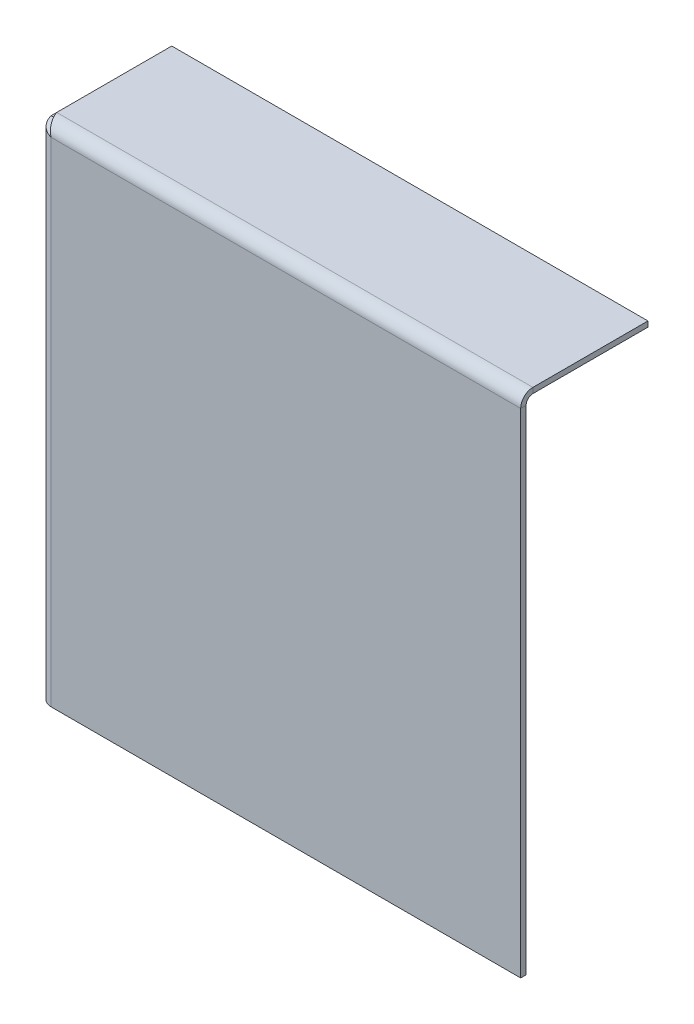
ISO-10303-21;
HEADER;
FILE_DESCRIPTION(('STEP AP214'),'2;1');
FILE_NAME('part.step','',(''),(''),'','','');
FILE_SCHEMA(('AUTOMOTIVE_DESIGN { 1 0 10303 214 1 1 1 1 }'));
ENDSEC;
DATA;
#1=APPLICATION_CONTEXT('core data for automotive mechanical design processes');
#2=APPLICATION_PROTOCOL_DEFINITION('international standard','automotive_design',2000,#1);
#3=PRODUCT_CONTEXT('',#1,'mechanical');
#4=PRODUCT('Part','Part','',(#3));
#5=PRODUCT_RELATED_PRODUCT_CATEGORY('part','',(#4));
#6=PRODUCT_DEFINITION_FORMATION('','',#4);
#7=PRODUCT_DEFINITION_CONTEXT('part definition',#1,'design');
#8=PRODUCT_DEFINITION('design','',#6,#7);
#9=PRODUCT_DEFINITION_SHAPE('','',#8);
#10=(LENGTH_UNIT() NAMED_UNIT(*) SI_UNIT(.MILLI.,.METRE.));
#11=(NAMED_UNIT(*) PLANE_ANGLE_UNIT() SI_UNIT($,.RADIAN.));
#12=(NAMED_UNIT(*) SI_UNIT($,.STERADIAN.) SOLID_ANGLE_UNIT());
#13=UNCERTAINTY_MEASURE_WITH_UNIT(LENGTH_MEASURE(1.E-05),#10,'distance_accuracy_value','');
#14=(GEOMETRIC_REPRESENTATION_CONTEXT(3) GLOBAL_UNCERTAINTY_ASSIGNED_CONTEXT((#13)) GLOBAL_UNIT_ASSIGNED_CONTEXT((#10,
#11,#12)) REPRESENTATION_CONTEXT('',''));
#15=CARTESIAN_POINT('',(0.,0.,0.));
#16=DIRECTION('',(0.,0.,1.));
#17=DIRECTION('',(1.,0.,0.));
#18=AXIS2_PLACEMENT_3D('',#15,#16,#17);
#19=CARTESIAN_POINT('',(0.,-182.191293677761,2.));
#20=DIRECTION('',(0.,1.,0.));
#21=DIRECTION('',(0.,0.,1.));
#22=AXIS2_PLACEMENT_3D('',#19,#20,#21);
#23=PLANE('',#22);
#24=DIRECTION('',(1.,0.,0.));
#25=VECTOR('',#24,1.);
#26=CARTESIAN_POINT('',(0.,-182.191293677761,0.));
#27=LINE('',#26,#25);
#28=CARTESIAN_POINT('',(0.,-182.191293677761,0.));
#29=VERTEX_POINT('',#28);
#30=CARTESIAN_POINT('',(173.469526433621,-182.191293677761,0.));
#31=VERTEX_POINT('',#30);
#32=EDGE_CURVE('E255',#29,#31,#27,.T.);
#33=ORIENTED_EDGE('',*,*,#32,.T.);
#34=DIRECTION('',(0.,0.,-1.));
#35=VECTOR('',#34,1.);
#36=CARTESIAN_POINT('',(173.469526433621,-182.191293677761,2.));
#37=LINE('',#36,#35);
#38=CARTESIAN_POINT('',(173.469526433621,-182.191293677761,2.));
#39=VERTEX_POINT('',#38);
#40=EDGE_CURVE('E83',#39,#31,#37,.T.);
#41=ORIENTED_EDGE('',*,*,#40,.F.);
#42=DIRECTION('',(1.,0.,0.));
#43=VECTOR('',#42,1.);
#44=CARTESIAN_POINT('',(0.,-182.191293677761,2.));
#45=LINE('',#44,#43);
#46=CARTESIAN_POINT('',(0.,-182.191293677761,2.));
#47=VERTEX_POINT('',#46);
#48=EDGE_CURVE('E90',#47,#39,#45,.T.);
#49=ORIENTED_EDGE('',*,*,#48,.F.);
#50=DIRECTION('',(0.,0.,-1.));
#51=VECTOR('',#50,1.);
#52=CARTESIAN_POINT('',(0.,-182.191293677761,2.));
#53=LINE('',#52,#51);
#54=EDGE_CURVE('E13',#47,#29,#53,.T.);
#55=ORIENTED_EDGE('',*,*,#54,.T.);
#56=EDGE_LOOP('',(#33,#41,#49,#55));
#57=FACE_BOUND('',#56,.T.);
#58=ADVANCED_FACE('F75',(#57),#23,.F.);
#59=CARTESIAN_POINT('',(173.469526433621,0.,2.));
#60=DIRECTION('',(-1.,0.,0.));
#61=DIRECTION('',(0.,-1.,0.));
#62=AXIS2_PLACEMENT_3D('',#59,#60,#61);
#63=PLANE('',#62);
#64=DIRECTION('',(0.,1.,0.));
#65=VECTOR('',#64,1.);
#66=CARTESIAN_POINT('',(173.469526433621,0.,0.));
#67=LINE('',#66,#65);
#68=CARTESIAN_POINT('',(173.469526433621,0.,0.));
#69=VERTEX_POINT('',#68);
#70=EDGE_CURVE('E262',#31,#69,#67,.T.);
#71=ORIENTED_EDGE('',*,*,#70,.T.);
#72=DIRECTION('',(0.,0.,-1.));
#73=VECTOR('',#72,1.);
#74=CARTESIAN_POINT('',(173.469526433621,0.,2.));
#75=LINE('',#74,#73);
#76=CARTESIAN_POINT('',(173.469526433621,0.,2.));
#77=VERTEX_POINT('',#76);
#78=EDGE_CURVE('E269',#77,#69,#75,.T.);
#79=ORIENTED_EDGE('',*,*,#78,.F.);
#80=DIRECTION('',(0.,1.,0.));
#81=VECTOR('',#80,1.);
#82=CARTESIAN_POINT('',(173.469526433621,0.,2.));
#83=LINE('',#82,#81);
#84=EDGE_CURVE('E268',#39,#77,#83,.T.);
#85=ORIENTED_EDGE('',*,*,#84,.F.);
#86=ORIENTED_EDGE('',*,*,#40,.T.);
#87=EDGE_LOOP('',(#71,#79,#85,#86));
#88=FACE_BOUND('',#87,.T.);
#89=ADVANCED_FACE('F246',(#88),#63,.F.);
#90=CARTESIAN_POINT('',(0.,-182.191293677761,2.));
#91=DIRECTION('',(0.,0.,1.));
#92=DIRECTION('',(1.,0.,0.));
#93=AXIS2_PLACEMENT_3D('',#90,#91,#92);
#94=PLANE('',#93);
#95=DIRECTION('',(0.,-1.,0.));
#96=VECTOR('',#95,1.);
#97=CARTESIAN_POINT('',(0.,0.,2.));
#98=LINE('',#97,#96);
#99=CARTESIAN_POINT('',(0.,0.,2.));
#100=VERTEX_POINT('',#99);
#101=EDGE_CURVE('E273',#100,#47,#98,.T.);
#102=ORIENTED_EDGE('',*,*,#101,.T.);
#103=ORIENTED_EDGE('',*,*,#48,.T.);
#104=ORIENTED_EDGE('',*,*,#84,.T.);
#105=DIRECTION('',(-1.,0.,0.));
#106=VECTOR('',#105,1.);
#107=CARTESIAN_POINT('',(0.,0.,2.));
#108=LINE('',#107,#106);
#109=EDGE_CURVE('E280',#77,#100,#108,.T.);
#110=ORIENTED_EDGE('',*,*,#109,.T.);
#111=EDGE_LOOP('',(#102,#103,#104,#110));
#112=FACE_BOUND('',#111,.T.);
#113=ADVANCED_FACE('F251',(#112),#94,.T.);
#114=CARTESIAN_POINT('',(0.,-182.191293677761,0.));
#115=DIRECTION('',(0.,0.,1.));
#116=DIRECTION('',(1.,0.,0.));
#117=AXIS2_PLACEMENT_3D('',#114,#115,#116);
#118=PLANE('',#117);
#119=DIRECTION('',(0.,-1.,0.));
#120=VECTOR('',#119,1.);
#121=CARTESIAN_POINT('',(0.,0.,0.));
#122=LINE('',#121,#120);
#123=CARTESIAN_POINT('',(0.,0.,0.));
#124=VERTEX_POINT('',#123);
#125=EDGE_CURVE('E263',#124,#29,#122,.T.);
#126=ORIENTED_EDGE('',*,*,#125,.F.);
#127=DIRECTION('',(-1.,0.,0.));
#128=VECTOR('',#127,1.);
#129=CARTESIAN_POINT('',(0.,0.,0.));
#130=LINE('',#129,#128);
#131=EDGE_CURVE('E271',#69,#124,#130,.T.);
#132=ORIENTED_EDGE('',*,*,#131,.F.);
#133=ORIENTED_EDGE('',*,*,#70,.F.);
#134=ORIENTED_EDGE('',*,*,#32,.F.);
#135=EDGE_LOOP('',(#126,#132,#133,#134));
#136=FACE_BOUND('',#135,.T.);
#137=ADVANCED_FACE('F270',(#136),#118,.F.);
#138=CARTESIAN_POINT('',(0.,-182.191293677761,-2.5));
#139=DIRECTION('',(0.,-1.,0.));
#140=DIRECTION('',(0.,0.,-1.));
#141=AXIS2_PLACEMENT_3D('',#138,#139,#140);
#142=PLANE('',#141);
#143=DIRECTION('',(1.,0.,0.));
#144=VECTOR('',#143,1.);
#145=CARTESIAN_POINT('',(-4.5,-182.191293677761,-2.49999999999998));
#146=LINE('',#145,#144);
#147=CARTESIAN_POINT('',(-2.5,-182.191293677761,-2.49999999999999));
#148=VERTEX_POINT('',#147);
#149=CARTESIAN_POINT('',(-4.5,-182.191293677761,-2.49999999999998));
#150=VERTEX_POINT('',#149);
#151=EDGE_CURVE('E350',#148,#150,#146,.F.);
#152=ORIENTED_EDGE('',*,*,#151,.F.);
#153=CARTESIAN_POINT('',(0.,-182.191293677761,-2.5));
#154=DIRECTION('',(0.,1.,0.));
#155=DIRECTION('',(0.,0.,1.));
#156=AXIS2_PLACEMENT_3D('',#153,#154,#155);
#157=CIRCLE('',#156,2.5);
#158=EDGE_CURVE('E308',#29,#148,#157,.F.);
#159=ORIENTED_EDGE('',*,*,#158,.F.);
#160=ORIENTED_EDGE('',*,*,#54,.F.);
#161=CARTESIAN_POINT('',(0.,-182.191293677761,-2.5));
#162=DIRECTION('',(0.,1.,0.));
#163=DIRECTION('',(0.,0.,1.));
#164=AXIS2_PLACEMENT_3D('',#161,#162,#163);
#165=CIRCLE('',#164,4.5);
#166=EDGE_CURVE('E297',#47,#150,#165,.F.);
#167=ORIENTED_EDGE('',*,*,#166,.T.);
#168=EDGE_LOOP('',(#152,#159,#160,#167));
#169=FACE_BOUND('',#168,.T.);
#170=ADVANCED_FACE('F337',(#169),#142,.T.);
#171=CARTESIAN_POINT('',(-4.52,2.42928932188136,-2.49999999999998));
#172=CARTESIAN_POINT('',(-4.52,2.22681583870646,-1.90823787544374));
#173=CARTESIAN_POINT('',(-4.40235649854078,2.02440776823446,-1.31689956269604));
#174=CARTESIAN_POINT('',(-3.94951447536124,1.61952621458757,-0.223642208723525));
#175=CARTESIAN_POINT('',(-3.61449412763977,1.41708543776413,0.277751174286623));
#176=CARTESIAN_POINT('',(-2.77775117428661,1.01220388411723,1.11449412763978));
#177=CARTESIAN_POINT('',(-2.27635779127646,0.809763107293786,1.44951447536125));
#178=CARTESIAN_POINT('',(-1.18310043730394,0.404881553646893,1.90235649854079));
#179=CARTESIAN_POINT('',(-0.591762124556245,0.202473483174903,2.02));
#180=CARTESIAN_POINT('',(0.,0.,2.02));
#181=CARTESIAN_POINT('',(-4.5,2.42928932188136,-2.49999999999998));
#182=CARTESIAN_POINT('',(-4.5,2.22681590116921,-1.91085639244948));
#183=CARTESIAN_POINT('',(-4.38287704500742,2.02440776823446,-1.32213452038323));
#184=CARTESIAN_POINT('',(-3.93203874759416,1.61952621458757,-0.233714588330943));
#185=CARTESIAN_POINT('',(-3.59850079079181,1.41708543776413,0.265460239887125));
#186=CARTESIAN_POINT('',(-2.76546023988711,1.01220388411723,1.09850079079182));
#187=CARTESIAN_POINT('',(-2.26628541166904,0.809763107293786,1.43203874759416));
#188=CARTESIAN_POINT('',(-1.17786547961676,0.404881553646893,1.88287704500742));
#189=CARTESIAN_POINT('',(-0.589143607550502,0.202473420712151,2.));
#190=CARTESIAN_POINT('',(0.,0.,2.));
#191=CARTESIAN_POINT('',(-2.5,2.42928932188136,-2.49999999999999));
#192=CARTESIAN_POINT('',(-2.5,2.22682214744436,-2.1727080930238));
#193=CARTESIAN_POINT('',(-2.43493169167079,2.02440776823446,-1.84563028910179));
#194=CARTESIAN_POINT('',(-2.18446597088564,1.61952621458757,-1.24095254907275));
#195=CARTESIAN_POINT('',(-1.99916710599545,1.41708543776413,-0.963633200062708));
#196=CARTESIAN_POINT('',(-1.53636679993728,1.01220388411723,-0.500832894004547));
#197=CARTESIAN_POINT('',(-1.25904745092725,0.809763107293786,-0.315534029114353));
#198=CARTESIAN_POINT('',(-0.654369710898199,0.404881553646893,-0.0650683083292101));
#199=CARTESIAN_POINT('',(-0.327291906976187,0.202467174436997,0.));
#200=CARTESIAN_POINT('',(0.,0.,0.));
#201=CARTESIAN_POINT('',(-2.4798,2.42928932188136,-2.49999999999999));
#202=CARTESIAN_POINT('',(-2.4798,2.22682221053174,-2.1753527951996));
#203=CARTESIAN_POINT('',(-2.41525744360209,2.02440776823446,-1.85091759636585));
#204=CARTESIAN_POINT('',(-2.16681548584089,1.61952621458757,-1.25112565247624));
#205=CARTESIAN_POINT('',(-1.983013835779,1.41708543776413,-0.976047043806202));
#206=CARTESIAN_POINT('',(-1.52395295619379,1.01220388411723,-0.51698616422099));
#207=CARTESIAN_POINT('',(-1.24887434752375,0.809763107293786,-0.333184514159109));
#208=CARTESIAN_POINT('',(-0.649082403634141,0.404881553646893,-0.0847425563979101));
#209=CARTESIAN_POINT('',(-0.324647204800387,0.202467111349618,-0.0201999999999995));
#210=CARTESIAN_POINT('',(0.,0.,-0.0201999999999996));
#211=B_SPLINE_SURFACE_WITH_KNOTS('',1,3,((#171,#172,#173,#174,#175,#176,#177,#178,#179,#180),
(#181,#182,#183,#184,#185,#186,#187,#188,#189,#190),(#191,#192,#193,#194,#195,#196,#197,#198,
#199,#200),(#201,#202,#203,#204,#205,#206,#207,#208,#209,#210)),.UNSPECIFIED.,.F.,.F.,.F.,(2,1,
1,2),(4,2,2,2,4),(-0.01,0.,1.,1.0101),(0.,0.25,0.5,0.75,1.),.UNSPECIFIED.);
#212=CARTESIAN_POINT('',(-2.5,2.42928932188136,-2.49999999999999));
#213=CARTESIAN_POINT('',(-2.50000872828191,2.38396475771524,-2.42673519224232));
#214=CARTESIAN_POINT('',(-2.49677966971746,2.33864121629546,-2.35347160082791));
#215=CARTESIAN_POINT('',(-2.48391002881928,2.24800145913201,-2.20751800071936));
#216=CARTESIAN_POINT('',(-2.47427026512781,2.20268524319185,-2.13482791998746));
#217=CARTESIAN_POINT('',(-2.44863790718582,2.11203500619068,-1.99054351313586));
#218=CARTESIAN_POINT('',(-2.43264267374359,2.06670098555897,-1.9189496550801));
#219=CARTESIAN_POINT('',(-2.39442737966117,1.97602801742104,-1.7774420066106));
#220=CARTESIAN_POINT('',(-2.37220679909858,1.93068906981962,-1.70752835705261));
#221=CARTESIAN_POINT('',(-2.31845602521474,1.83417259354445,-1.5610646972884));
#222=CARTESIAN_POINT('',(-2.28609610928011,1.78299402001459,-1.48481744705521));
#223=CARTESIAN_POINT('',(-2.21398023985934,1.68063134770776,-1.33589072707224));
#224=CARTESIAN_POINT('',(-2.17422121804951,1.62944725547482,-1.26321275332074));
#225=CARTESIAN_POINT('',(-2.04446723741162,1.47597280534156,-1.05175014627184));
#226=CARTESIAN_POINT('',(-1.94391070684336,1.3736119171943,-0.919307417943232));
#227=CARTESIAN_POINT('',(-1.71860596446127,1.16886725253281,-0.676875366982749));
#228=CARTESIAN_POINT('',(-1.59385390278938,1.06648347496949,-0.56688962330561));
#229=CARTESIAN_POINT('',(-1.39239422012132,0.912975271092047,-0.421990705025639));
#230=CARTESIAN_POINT('',(-1.3227889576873,0.861774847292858,-0.377008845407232));
#231=CARTESIAN_POINT('',(-1.17947393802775,0.75937589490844,-0.294171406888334));
#232=CARTESIAN_POINT('',(-1.10576562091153,0.708177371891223,-0.256313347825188));
#233=CARTESIAN_POINT('',(-0.94978845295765,0.602270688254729,-0.185756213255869));
#234=CARTESIAN_POINT('',(-0.867279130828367,0.547562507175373,-0.153588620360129));
#235=CARTESIAN_POINT('',(-0.699308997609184,0.438143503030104,-0.0981694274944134));
#236=CARTESIAN_POINT('',(-0.613847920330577,0.38343268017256,-0.0749186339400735));
#237=CARTESIAN_POINT('',(-0.440823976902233,0.273937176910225,-0.0375802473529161));
#238=CARTESIAN_POINT('',(-0.353258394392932,0.219152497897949,-0.0235052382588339));
#239=CARTESIAN_POINT('',(-0.177129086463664,0.10957949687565,-0.00470543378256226));
#240=CARTESIAN_POINT('',(-0.0885653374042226,0.0547911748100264,1.91396843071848E-05));
#241=CARTESIAN_POINT('',(0.,0.,0.));
#242=B_SPLINE_CURVE_WITH_KNOTS('',3,(#212,#213,#214,#215,#216,#217,#218,#219,#220,#221,#222,
#223,#224,#225,#226,#227,#228,#229,#230,#231,#232,#233,#234,#235,#236,#237,#238,#239,#240,#241),
.UNSPECIFIED.,.F.,.F.,(4,2,2,2,2,2,2,2,2,2,2,2,2,2,4),(0.,0.258390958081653,0.516748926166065,
0.775214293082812,1.03370125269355,1.32542887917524,1.61727775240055,2.2001284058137,
2.78307187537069,3.07502634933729,3.36687899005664,3.67873630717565,3.99062182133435,
4.30293416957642,4.61525392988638),.UNSPECIFIED.);
#243=CARTESIAN_POINT('',(-2.5,2.42928932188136,-2.49999999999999));
#244=VERTEX_POINT('',#243);
#245=EDGE_CURVE('E313',#244,#124,#242,.T.);
#246=DIRECTION('',(1.,0.,0.));
#247=VECTOR('',#246,1.);
#248=CARTESIAN_POINT('',(-2.5,2.42928932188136,-2.49999999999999));
#249=LINE('',#248,#247);
#250=CARTESIAN_POINT('',(-4.5,2.42928932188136,-2.49999999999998));
#251=VERTEX_POINT('',#250);
#252=EDGE_CURVE('E218',#244,#251,#249,.F.);
#253=CARTESIAN_POINT('',(-4.5,2.42928932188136,-2.49999999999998));
#254=CARTESIAN_POINT('',(-4.50001700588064,2.3832857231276,-2.36614765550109));
#255=CARTESIAN_POINT('',(-4.49402856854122,2.33728316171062,-2.23229752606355));
#256=CARTESIAN_POINT('',(-4.47016352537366,2.24528249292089,-1.96566749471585));
#257=CARTESIAN_POINT('',(-4.45228756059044,2.19928438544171,-1.83288753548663));
#258=CARTESIAN_POINT('',(-4.40478896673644,2.10732646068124,-1.56955326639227));
#259=CARTESIAN_POINT('',(-4.37517564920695,2.06136664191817,-1.43899727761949));
#260=CARTESIAN_POINT('',(-4.30444383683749,1.96944346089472,-1.18104356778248));
#261=CARTESIAN_POINT('',(-4.26332549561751,1.92348009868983,-1.05364580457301));
#262=CARTESIAN_POINT('',(-4.16987954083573,1.83152553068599,-0.802939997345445));
#263=CARTESIAN_POINT('',(-4.11754503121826,1.78553432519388,-0.679634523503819));
#264=CARTESIAN_POINT('',(-4.00207713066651,1.69353500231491,-0.438132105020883));
#265=CARTESIAN_POINT('',(-3.93893977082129,1.64752688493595,-0.319937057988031));
#266=CARTESIAN_POINT('',(-3.8024230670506,1.55554285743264,-0.0897142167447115));
#267=CARTESIAN_POINT('',(-3.72905002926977,1.50956694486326,0.0223173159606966));
#268=CARTESIAN_POINT('',(-3.57259001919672,1.41759610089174,0.239436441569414));
#269=CARTESIAN_POINT('',(-3.48949968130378,1.37160116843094,0.344521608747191));
#270=CARTESIAN_POINT('',(-3.3143079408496,1.27962149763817,0.546845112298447));
#271=CARTESIAN_POINT('',(-3.22220876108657,1.23363675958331,0.64408537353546));
#272=CARTESIAN_POINT('',(-3.02971447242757,1.14166656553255,0.829974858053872));
#273=CARTESIAN_POINT('',(-2.9293193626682,1.09568110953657,0.918624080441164));
#274=CARTESIAN_POINT('',(-2.72097006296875,1.00368745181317,1.08667601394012));
#275=CARTESIAN_POINT('',(-2.61301154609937,0.957679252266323,1.16607336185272));
#276=CARTESIAN_POINT('',(-2.39048593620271,0.865678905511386,1.31490337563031));
#277=CARTESIAN_POINT('',(-2.27592115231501,0.819686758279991,1.38433949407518));
#278=CARTESIAN_POINT('',(-2.04096721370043,0.727661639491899,1.51277864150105));
#279=CARTESIAN_POINT('',(-1.9205734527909,0.681628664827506,1.57177324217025));
#280=CARTESIAN_POINT('',(-1.67504978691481,0.589580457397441,1.67877180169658));
#281=CARTESIAN_POINT('',(-1.54992165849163,0.543565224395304,1.72677983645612));
#282=CARTESIAN_POINT('',(-1.29599917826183,0.45157767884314,1.81141286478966));
#283=CARTESIAN_POINT('',(-1.16720820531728,0.405605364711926,1.84804800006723));
#284=CARTESIAN_POINT('',(-0.906922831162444,0.313680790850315,1.90969031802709));
#285=CARTESIAN_POINT('',(-0.775429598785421,0.267728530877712,1.93470242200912));
#286=CARTESIAN_POINT('',(-0.536551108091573,0.184782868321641,1.96919477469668));
#287=CARTESIAN_POINT('',(-0.4294610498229,0.147788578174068,1.98075184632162));
#288=CARTESIAN_POINT('',(-0.214916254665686,0.0738637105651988,1.99615061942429));
#289=CARTESIAN_POINT('',(-0.107462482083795,0.036933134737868,2.00000576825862));
#290=CARTESIAN_POINT('',(0.,0.,2.));
#291=B_SPLINE_CURVE_WITH_KNOTS('',3,(#253,#254,#255,#256,#257,#258,#259,#260,#261,#262,#263,
#264,#265,#266,#267,#268,#269,#270,#271,#272,#273,#274,#275,#276,#277,#278,#279,#280,#281,#282,
#283,#284,#285,#286,#287,#288,#289,#290),.UNSPECIFIED.,.F.,.F.,(4,2,2,2,2,2,2,2,2,2,2,2,2,2,2,2,
2,2,4),(0.,0.424481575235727,0.848940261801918,1.27306288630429,1.69717984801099,
2.12155832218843,2.54609304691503,2.97036736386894,3.39478906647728,3.81910631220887,
4.24342360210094,4.66798565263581,5.09240019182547,5.51715576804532,5.94175350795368,
6.36597152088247,6.79000975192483,7.13141947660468,7.47223258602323),.UNSPECIFIED.);
#292=EDGE_CURVE('E303',#251,#100,#291,.T.);
#293=DIRECTION('',(0.,0.,-1.));
#294=VECTOR('',#293,1.);
#295=CARTESIAN_POINT('',(0.,0.,2.));
#296=LINE('',#295,#294);
#297=EDGE_CURVE('E277',#100,#124,#296,.T.);
#298=ORIENTED_EDGE('',*,*,#245,.F.);
#299=ORIENTED_EDGE('',*,*,#252,.T.);
#300=ORIENTED_EDGE('',*,*,#292,.T.);
#301=ORIENTED_EDGE('',*,*,#297,.T.);
#302=EDGE_LOOP('',(#298,#299,#300,#301));
#303=FACE_BOUND('',#302,.T.);
#304=ADVANCED_FACE('F325',(#303),#211,.F.);
#305=CARTESIAN_POINT('',(0.,2.42928932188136,-2.5));
#306=DIRECTION('',(0.,1.,0.));
#307=DIRECTION('',(-1.,0.,0.));
#308=AXIS2_PLACEMENT_3D('',#305,#306,#307);
#309=CYLINDRICAL_SURFACE('',#308,4.5);
#310=ORIENTED_EDGE('',*,*,#101,.F.);
#311=ORIENTED_EDGE('',*,*,#292,.F.);
#312=DIRECTION('',(0.,1.,0.));
#313=VECTOR('',#312,1.);
#314=CARTESIAN_POINT('',(-4.5,-182.191293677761,-2.49999999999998));
#315=LINE('',#314,#313);
#316=EDGE_CURVE('E367',#251,#150,#315,.F.);
#317=ORIENTED_EDGE('',*,*,#316,.T.);
#318=ORIENTED_EDGE('',*,*,#166,.F.);
#319=EDGE_LOOP('',(#310,#311,#317,#318));
#320=FACE_BOUND('',#319,.T.);
#321=ADVANCED_FACE('F331',(#320),#309,.T.);
#322=CARTESIAN_POINT('',(0.,2.42928932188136,-2.5));
#323=DIRECTION('',(0.,1.,0.));
#324=DIRECTION('',(-1.,0.,0.));
#325=AXIS2_PLACEMENT_3D('',#322,#323,#324);
#326=CYLINDRICAL_SURFACE('',#325,2.5);
#327=ORIENTED_EDGE('',*,*,#125,.T.);
#328=ORIENTED_EDGE('',*,*,#158,.T.);
#329=DIRECTION('',(0.,1.,0.));
#330=VECTOR('',#329,1.);
#331=CARTESIAN_POINT('',(-2.5,-182.191293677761,-2.49999999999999));
#332=LINE('',#331,#330);
#333=EDGE_CURVE('E355',#148,#244,#332,.T.);
#334=ORIENTED_EDGE('',*,*,#333,.T.);
#335=ORIENTED_EDGE('',*,*,#245,.T.);
#336=EDGE_LOOP('',(#327,#328,#334,#335));
#337=FACE_BOUND('',#336,.T.);
#338=ADVANCED_FACE('F335',(#337),#326,.F.);
#339=CARTESIAN_POINT('',(-4.49999999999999,-182.191293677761,0.));
#340=DIRECTION('',(0.,1.,0.));
#341=DIRECTION('',(0.,0.,1.));
#342=AXIS2_PLACEMENT_3D('',#339,#340,#341);
#343=PLANE('',#342);
#344=ORIENTED_EDGE('',*,*,#151,.T.);
#345=DIRECTION('',(0.,0.,1.));
#346=VECTOR('',#345,1.);
#347=CARTESIAN_POINT('',(-4.49999999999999,-182.191293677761,0.));
#348=LINE('',#347,#346);
#349=CARTESIAN_POINT('',(-4.50000000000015,-182.191293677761,-45.));
#350=VERTEX_POINT('',#349);
#351=EDGE_CURVE('E375',#350,#150,#348,.T.);
#352=ORIENTED_EDGE('',*,*,#351,.F.);
#353=DIRECTION('',(1.,0.,0.));
#354=VECTOR('',#353,1.);
#355=CARTESIAN_POINT('',(-4.50000000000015,-182.191293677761,-45.));
#356=LINE('',#355,#354);
#357=CARTESIAN_POINT('',(-2.50000000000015,-182.191293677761,-45.));
#358=VERTEX_POINT('',#357);
#359=EDGE_CURVE('E371',#350,#358,#356,.T.);
#360=ORIENTED_EDGE('',*,*,#359,.T.);
#361=DIRECTION('',(0.,0.,-1.));
#362=VECTOR('',#361,1.);
#363=CARTESIAN_POINT('',(-2.49999999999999,-182.191293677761,0.));
#364=LINE('',#363,#362);
#365=EDGE_CURVE('E364',#358,#148,#364,.F.);
#366=ORIENTED_EDGE('',*,*,#365,.T.);
#367=EDGE_LOOP('',(#344,#352,#360,#366));
#368=FACE_BOUND('',#367,.T.);
#369=ADVANCED_FACE('F342',(#368),#343,.F.);
#370=CARTESIAN_POINT('',(-4.49999999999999,0.,0.));
#371=DIRECTION('',(1.,0.,0.));
#372=DIRECTION('',(0.,0.,-1.));
#373=AXIS2_PLACEMENT_3D('',#370,#371,#372);
#374=PLANE('',#373);
#375=ORIENTED_EDGE('',*,*,#316,.F.);
#376=DIRECTION('',(0.,0.,-1.));
#377=VECTOR('',#376,1.);
#378=CARTESIAN_POINT('',(-4.49999999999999,2.42928932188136,0.));
#379=LINE('',#378,#377);
#380=CARTESIAN_POINT('',(-4.50000000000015,2.42928932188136,-45.));
#381=VERTEX_POINT('',#380);
#382=EDGE_CURVE('E356',#251,#381,#379,.T.);
#383=ORIENTED_EDGE('',*,*,#382,.T.);
#384=DIRECTION('',(0.,-1.,0.));
#385=VECTOR('',#384,1.);
#386=CARTESIAN_POINT('',(-4.50000000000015,0.,-45.));
#387=LINE('',#386,#385);
#388=EDGE_CURVE('E372',#381,#350,#387,.T.);
#389=ORIENTED_EDGE('',*,*,#388,.T.);
#390=ORIENTED_EDGE('',*,*,#351,.T.);
#391=EDGE_LOOP('',(#375,#383,#389,#390));
#392=FACE_BOUND('',#391,.T.);
#393=ADVANCED_FACE('F392',(#392),#374,.F.);
#394=CARTESIAN_POINT('',(-2.49999999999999,0.,0.));
#395=DIRECTION('',(1.,0.,0.));
#396=DIRECTION('',(0.,0.,-1.));
#397=AXIS2_PLACEMENT_3D('',#394,#395,#396);
#398=PLANE('',#397);
#399=DIRECTION('',(0.,1.,0.));
#400=VECTOR('',#399,1.);
#401=CARTESIAN_POINT('',(-2.50000000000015,-182.191293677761,-45.));
#402=LINE('',#401,#400);
#403=CARTESIAN_POINT('',(-2.50000000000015,2.42928932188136,-45.));
#404=VERTEX_POINT('',#403);
#405=EDGE_CURVE('E373',#404,#358,#402,.F.);
#406=ORIENTED_EDGE('',*,*,#405,.F.);
#407=DIRECTION('',(0.,0.,1.));
#408=VECTOR('',#407,1.);
#409=CARTESIAN_POINT('',(-2.50000000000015,2.42928932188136,-45.));
#410=LINE('',#409,#408);
#411=EDGE_CURVE('E366',#244,#404,#410,.F.);
#412=ORIENTED_EDGE('',*,*,#411,.F.);
#413=ORIENTED_EDGE('',*,*,#333,.F.);
#414=ORIENTED_EDGE('',*,*,#365,.F.);
#415=EDGE_LOOP('',(#406,#412,#413,#414));
#416=FACE_BOUND('',#415,.T.);
#417=ADVANCED_FACE('F363',(#416),#398,.T.);
#418=CARTESIAN_POINT('',(-4.50000000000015,-182.191293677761,-45.));
#419=DIRECTION('',(0.,0.,1.));
#420=DIRECTION('',(1.,0.,0.));
#421=AXIS2_PLACEMENT_3D('',#418,#419,#420);
#422=PLANE('',#421);
#423=ORIENTED_EDGE('',*,*,#405,.T.);
#424=ORIENTED_EDGE('',*,*,#359,.F.);
#425=ORIENTED_EDGE('',*,*,#388,.F.);
#426=DIRECTION('',(1.,0.,0.));
#427=VECTOR('',#426,1.);
#428=CARTESIAN_POINT('',(-4.50000000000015,2.42928932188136,-45.));
#429=LINE('',#428,#427);
#430=EDGE_CURVE('E383',#381,#404,#429,.T.);
#431=ORIENTED_EDGE('',*,*,#430,.T.);
#432=EDGE_LOOP('',(#423,#424,#425,#431));
#433=FACE_BOUND('',#432,.T.);
#434=ADVANCED_FACE('F338',(#433),#422,.F.);
#435=CARTESIAN_POINT('',(-4.50000000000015,2.42928932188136,-45.));
#436=DIRECTION('',(0.,-1.,0.));
#437=DIRECTION('',(0.,0.,-1.));
#438=AXIS2_PLACEMENT_3D('',#435,#436,#437);
#439=PLANE('',#438);
#440=ORIENTED_EDGE('',*,*,#252,.F.);
#441=ORIENTED_EDGE('',*,*,#411,.T.);
#442=ORIENTED_EDGE('',*,*,#430,.F.);
#443=ORIENTED_EDGE('',*,*,#382,.F.);
#444=EDGE_LOOP('',(#440,#441,#442,#443));
#445=FACE_BOUND('',#444,.T.);
#446=ADVANCED_FACE('F393',(#445),#439,.F.);
#447=CARTESIAN_POINT('',(0.,0.,2.02));
#448=CARTESIAN_POINT('',(-0.202473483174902,0.591762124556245,2.02));
#449=CARTESIAN_POINT('',(-0.404881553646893,1.18310043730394,1.90235649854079));
#450=CARTESIAN_POINT('',(-0.809763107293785,2.27635779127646,1.44951447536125));
#451=CARTESIAN_POINT('',(-1.01220388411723,2.77775117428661,1.11449412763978));
#452=CARTESIAN_POINT('',(-1.41708543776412,3.61449412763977,0.277751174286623));
#453=CARTESIAN_POINT('',(-1.61952621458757,3.94951447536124,-0.223642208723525));
#454=CARTESIAN_POINT('',(-2.02440776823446,4.40235649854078,-1.31689956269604));
#455=CARTESIAN_POINT('',(-2.22681583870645,4.52,-1.90823787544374));
#456=CARTESIAN_POINT('',(-2.42928932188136,4.52,-2.49999999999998));
#457=CARTESIAN_POINT('',(0.,0.,2.));
#458=CARTESIAN_POINT('',(-0.202473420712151,0.589143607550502,2.));
#459=CARTESIAN_POINT('',(-0.404881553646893,1.17786547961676,1.88287704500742));
#460=CARTESIAN_POINT('',(-0.809763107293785,2.26628541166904,1.43203874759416));
#461=CARTESIAN_POINT('',(-1.01220388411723,2.76546023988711,1.09850079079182));
#462=CARTESIAN_POINT('',(-1.41708543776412,3.59850079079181,0.265460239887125));
#463=CARTESIAN_POINT('',(-1.61952621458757,3.93203874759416,-0.233714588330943));
#464=CARTESIAN_POINT('',(-2.02440776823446,4.38287704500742,-1.32213452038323));
#465=CARTESIAN_POINT('',(-2.22681590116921,4.5,-1.91085639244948));
#466=CARTESIAN_POINT('',(-2.42928932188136,4.5,-2.49999999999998));
#467=CARTESIAN_POINT('',(0.,0.,0.));
#468=CARTESIAN_POINT('',(-0.202467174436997,0.327291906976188,0.));
#469=CARTESIAN_POINT('',(-0.404881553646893,0.654369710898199,-0.0650683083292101));
#470=CARTESIAN_POINT('',(-0.809763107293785,1.25904745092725,-0.315534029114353));
#471=CARTESIAN_POINT('',(-1.01220388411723,1.53636679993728,-0.500832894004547));
#472=CARTESIAN_POINT('',(-1.41708543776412,1.99916710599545,-0.963633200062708));
#473=CARTESIAN_POINT('',(-1.61952621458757,2.18446597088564,-1.24095254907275));
#474=CARTESIAN_POINT('',(-2.02440776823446,2.43493169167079,-1.84563028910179));
#475=CARTESIAN_POINT('',(-2.22682214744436,2.5,-2.1727080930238));
#476=CARTESIAN_POINT('',(-2.42928932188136,2.5,-2.49999999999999));
#477=CARTESIAN_POINT('',(0.,0.,-0.0201999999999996));
#478=CARTESIAN_POINT('',(-0.202467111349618,0.324647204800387,-0.0201999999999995));
#479=CARTESIAN_POINT('',(-0.404881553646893,0.649082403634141,-0.0847425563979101));
#480=CARTESIAN_POINT('',(-0.809763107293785,1.24887434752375,-0.333184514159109));
#481=CARTESIAN_POINT('',(-1.01220388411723,1.52395295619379,-0.51698616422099));
#482=CARTESIAN_POINT('',(-1.41708543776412,1.983013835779,-0.976047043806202));
#483=CARTESIAN_POINT('',(-1.61952621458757,2.16681548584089,-1.25112565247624));
#484=CARTESIAN_POINT('',(-2.02440776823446,2.41525744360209,-1.85091759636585));
#485=CARTESIAN_POINT('',(-2.22682221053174,2.4798,-2.1753527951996));
#486=CARTESIAN_POINT('',(-2.42928932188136,2.4798,-2.49999999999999));
#487=B_SPLINE_SURFACE_WITH_KNOTS('',1,3,((#447,#448,#449,#450,#451,#452,#453,#454,#455,#456),
(#457,#458,#459,#460,#461,#462,#463,#464,#465,#466),(#467,#468,#469,#470,#471,#472,#473,#474,
#475,#476),(#477,#478,#479,#480,#481,#482,#483,#484,#485,#486)),.UNSPECIFIED.,.F.,.F.,.F.,(2,1,
1,2),(4,2,2,2,4),(-0.01,0.,1.,1.0101),(0.,0.25,0.5,0.75,1.),.UNSPECIFIED.);
#488=DIRECTION('',(0.,-1.,0.));
#489=VECTOR('',#488,1.);
#490=CARTESIAN_POINT('',(-2.42928932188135,4.5,-2.49999999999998));
#491=LINE('',#490,#489);
#492=CARTESIAN_POINT('',(-2.42928932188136,2.5,-2.49999999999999));
#493=VERTEX_POINT('',#492);
#494=CARTESIAN_POINT('',(-2.42928932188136,4.5,-2.49999999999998));
#495=VERTEX_POINT('',#494);
#496=EDGE_CURVE('E204',#493,#495,#491,.F.);
#497=CARTESIAN_POINT('',(0.,0.,0.));
#498=CARTESIAN_POINT('',(-0.0453245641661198,0.0732648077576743,8.72828191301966E-06));
#499=CARTESIAN_POINT('',(-0.0906481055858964,0.146528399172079,-0.00322033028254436));
#500=CARTESIAN_POINT('',(-0.181287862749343,0.292481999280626,-0.0160899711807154));
#501=CARTESIAN_POINT('',(-0.226604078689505,0.365172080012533,-0.025729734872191));
#502=CARTESIAN_POINT('',(-0.317254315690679,0.509456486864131,-0.0513620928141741));
#503=CARTESIAN_POINT('',(-0.362588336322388,0.581050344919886,-0.0673573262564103));
#504=CARTESIAN_POINT('',(-0.453261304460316,0.722557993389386,-0.105572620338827));
#505=CARTESIAN_POINT('',(-0.498600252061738,0.792471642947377,-0.127793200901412));
#506=CARTESIAN_POINT('',(-0.595116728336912,0.938935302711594,-0.18154397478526));
#507=CARTESIAN_POINT('',(-0.646295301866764,1.01518255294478,-0.213903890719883));
#508=CARTESIAN_POINT('',(-0.748657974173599,1.16410927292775,-0.286019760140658));
#509=CARTESIAN_POINT('',(-0.799842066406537,1.23678724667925,-0.325778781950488));
#510=CARTESIAN_POINT('',(-0.953316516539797,1.44824985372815,-0.455532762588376));
#511=CARTESIAN_POINT('',(-1.05567740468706,1.58069258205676,-0.556089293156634));
#512=CARTESIAN_POINT('',(-1.26042206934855,1.82312463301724,-0.781394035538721));
#513=CARTESIAN_POINT('',(-1.36280584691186,1.93311037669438,-0.906146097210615));
#514=CARTESIAN_POINT('',(-1.51631405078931,2.07800929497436,-1.10760577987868));
#515=CARTESIAN_POINT('',(-1.5675144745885,2.12299115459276,-1.17721104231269));
#516=CARTESIAN_POINT('',(-1.66991342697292,2.20582859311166,-1.32052606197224));
#517=CARTESIAN_POINT('',(-1.72111194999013,2.24368665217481,-1.39423437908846));
#518=CARTESIAN_POINT('',(-1.82701863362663,2.31424378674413,-1.55021154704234));
#519=CARTESIAN_POINT('',(-1.88172681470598,2.34641137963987,-1.63272086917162));
#520=CARTESIAN_POINT('',(-1.99114581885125,2.40183057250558,-1.80069100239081));
#521=CARTESIAN_POINT('',(-2.0458566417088,2.42508136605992,-1.88615207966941));
#522=CARTESIAN_POINT('',(-2.15535214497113,2.46241975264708,-2.05917602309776));
#523=CARTESIAN_POINT('',(-2.21013682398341,2.47649476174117,-2.14674160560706));
#524=CARTESIAN_POINT('',(-2.31970982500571,2.49529456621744,-2.32287091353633));
#525=CARTESIAN_POINT('',(-2.37449814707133,2.50001913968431,-2.41143466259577));
#526=CARTESIAN_POINT('',(-2.42928932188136,2.5,-2.49999999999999));
#527=B_SPLINE_CURVE_WITH_KNOTS('',3,(#497,#498,#499,#500,#501,#502,#503,#504,#505,#506,#507,
#508,#509,#510,#511,#512,#513,#514,#515,#516,#517,#518,#519,#520,#521,#522,#523,#524,#525,#526),
.UNSPECIFIED.,.F.,.F.,(4,2,2,2,2,2,2,2,2,2,2,2,2,2,4),(0.,0.258390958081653,0.516748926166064,
0.775214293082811,1.03370125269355,1.32542887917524,1.61727775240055,2.2001284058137,
2.78307187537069,3.07502634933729,3.36687899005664,3.67873630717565,3.99062182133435,
4.30293416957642,4.61525392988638),.UNSPECIFIED.);
#528=EDGE_CURVE('E187',#124,#493,#527,.T.);
#529=CARTESIAN_POINT('',(0.,0.,2.));
#530=CARTESIAN_POINT('',(-0.0460035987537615,0.133852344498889,2.00001700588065));
#531=CARTESIAN_POINT('',(-0.0920061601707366,0.267702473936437,1.99402856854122));
#532=CARTESIAN_POINT('',(-0.184006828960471,0.534332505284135,1.97016352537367));
#533=CARTESIAN_POINT('',(-0.230004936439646,0.667112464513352,1.95228756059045));
#534=CARTESIAN_POINT('',(-0.321962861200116,0.930446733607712,1.90478896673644));
#535=CARTESIAN_POINT('',(-0.367922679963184,1.0610027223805,1.87517564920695));
#536=CARTESIAN_POINT('',(-0.459845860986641,1.31895643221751,1.80444383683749));
#537=CARTESIAN_POINT('',(-0.505809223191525,1.44635419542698,1.76332549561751));
#538=CARTESIAN_POINT('',(-0.597763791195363,1.69706000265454,1.66987954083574));
#539=CARTESIAN_POINT('',(-0.643754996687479,1.82036547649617,1.61754503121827));
#540=CARTESIAN_POINT('',(-0.735754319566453,2.0618678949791,1.50207713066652));
#541=CARTESIAN_POINT('',(-0.78176243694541,2.18006294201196,1.4389397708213));
#542=CARTESIAN_POINT('',(-0.873746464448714,2.41028578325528,1.30242306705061));
#543=CARTESIAN_POINT('',(-0.9197223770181,2.52231731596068,1.22905002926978));
#544=CARTESIAN_POINT('',(-1.01169322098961,2.7394364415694,1.07259001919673));
#545=CARTESIAN_POINT('',(-1.05768815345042,2.84452160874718,0.989499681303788));
#546=CARTESIAN_POINT('',(-1.14966782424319,3.04684511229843,0.814307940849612));
#547=CARTESIAN_POINT('',(-1.19565256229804,3.14408537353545,0.722208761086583));
#548=CARTESIAN_POINT('',(-1.2876227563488,3.32997485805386,0.529714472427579));
#549=CARTESIAN_POINT('',(-1.33360821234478,3.41862408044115,0.429319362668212));
#550=CARTESIAN_POINT('',(-1.42560187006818,3.58667601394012,0.220970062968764));
#551=CARTESIAN_POINT('',(-1.47161006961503,3.66607336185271,0.113011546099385));
#552=CARTESIAN_POINT('',(-1.56361041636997,3.8149033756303,-0.109514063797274));
#553=CARTESIAN_POINT('',(-1.60960256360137,3.88433949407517,-0.224078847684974));
#554=CARTESIAN_POINT('',(-1.70162768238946,4.01277864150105,-0.459032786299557));
#555=CARTESIAN_POINT('',(-1.74766065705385,4.07177324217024,-0.57942654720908));
#556=CARTESIAN_POINT('',(-1.83970886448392,4.17877180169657,-0.824950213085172));
#557=CARTESIAN_POINT('',(-1.88572409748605,4.22677983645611,-0.95007834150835));
#558=CARTESIAN_POINT('',(-1.97771164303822,4.31141286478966,-1.20400082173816));
#559=CARTESIAN_POINT('',(-2.02368395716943,4.34804800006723,-1.3327917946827));
#560=CARTESIAN_POINT('',(-2.11560853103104,4.40969031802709,-1.59307716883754));
#561=CARTESIAN_POINT('',(-2.16156079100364,4.43470242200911,-1.72457040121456));
#562=CARTESIAN_POINT('',(-2.24450645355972,4.46919477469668,-1.96344889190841));
#563=CARTESIAN_POINT('',(-2.28150074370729,4.48075184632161,-2.07053895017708));
#564=CARTESIAN_POINT('',(-2.35542561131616,4.49615061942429,-2.2850837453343));
#565=CARTESIAN_POINT('',(-2.39235618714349,4.50000576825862,-2.39253751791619));
#566=CARTESIAN_POINT('',(-2.42928932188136,4.5,-2.49999999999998));
#567=B_SPLINE_CURVE_WITH_KNOTS('',3,(#529,#530,#531,#532,#533,#534,#535,#536,#537,#538,#539,
#540,#541,#542,#543,#544,#545,#546,#547,#548,#549,#550,#551,#552,#553,#554,#555,#556,#557,#558,
#559,#560,#561,#562,#563,#564,#565,#566),.UNSPECIFIED.,.F.,.F.,(4,2,2,2,2,2,2,2,2,2,2,2,2,2,2,2,
2,2,4),(0.,0.424481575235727,0.848940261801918,1.27306288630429,1.69717984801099,
2.12155832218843,2.54609304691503,2.97036736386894,3.39478906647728,3.81910631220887,
4.24342360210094,4.66798565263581,5.09240019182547,5.51715576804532,5.94175350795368,
6.36597152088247,6.79000975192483,7.13141947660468,7.47223258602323),.UNSPECIFIED.);
#568=EDGE_CURVE('E209',#100,#495,#567,.T.);
#569=ORIENTED_EDGE('',*,*,#496,.F.);
#570=ORIENTED_EDGE('',*,*,#528,.F.);
#571=ORIENTED_EDGE('',*,*,#297,.F.);
#572=ORIENTED_EDGE('',*,*,#568,.T.);
#573=EDGE_LOOP('',(#569,#570,#571,#572));
#574=FACE_BOUND('',#573,.T.);
#575=ADVANCED_FACE('F224',(#574),#487,.F.);
#576=CARTESIAN_POINT('',(173.469526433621,0.,-2.5));
#577=DIRECTION('',(-1.,0.,0.));
#578=DIRECTION('',(0.,0.,1.));
#579=AXIS2_PLACEMENT_3D('',#576,#577,#578);
#580=PLANE('',#579);
#581=CARTESIAN_POINT('',(173.469526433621,0.,-2.5));
#582=DIRECTION('',(1.,0.,0.));
#583=DIRECTION('',(0.,0.,-1.));
#584=AXIS2_PLACEMENT_3D('',#581,#582,#583);
#585=CIRCLE('',#584,2.5);
#586=CARTESIAN_POINT('',(173.469526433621,2.5,-2.49999999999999));
#587=VERTEX_POINT('',#586);
#588=EDGE_CURVE('E184',#587,#69,#585,.T.);
#589=ORIENTED_EDGE('',*,*,#588,.F.);
#590=DIRECTION('',(0.,-1.,0.));
#591=VECTOR('',#590,1.);
#592=CARTESIAN_POINT('',(173.469526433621,2.5,-2.49999999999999));
#593=LINE('',#592,#591);
#594=CARTESIAN_POINT('',(173.469526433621,4.5,-2.49999999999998));
#595=VERTEX_POINT('',#594);
#596=EDGE_CURVE('E193',#587,#595,#593,.F.);
#597=ORIENTED_EDGE('',*,*,#596,.T.);
#598=CARTESIAN_POINT('',(173.469526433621,0.,-2.5));
#599=DIRECTION('',(1.,0.,0.));
#600=DIRECTION('',(0.,0.,-1.));
#601=AXIS2_PLACEMENT_3D('',#598,#599,#600);
#602=CIRCLE('',#601,4.5);
#603=EDGE_CURVE('E207',#595,#77,#602,.T.);
#604=ORIENTED_EDGE('',*,*,#603,.T.);
#605=ORIENTED_EDGE('',*,*,#78,.T.);
#606=EDGE_LOOP('',(#589,#597,#604,#605));
#607=FACE_BOUND('',#606,.T.);
#608=ADVANCED_FACE('F234',(#607),#580,.F.);
#609=CARTESIAN_POINT('',(173.469526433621,0.,-2.5));
#610=DIRECTION('',(1.,0.,0.));
#611=DIRECTION('',(0.,1.,0.));
#612=AXIS2_PLACEMENT_3D('',#609,#610,#611);
#613=CYLINDRICAL_SURFACE('',#612,4.5);
#614=ORIENTED_EDGE('',*,*,#109,.F.);
#615=ORIENTED_EDGE('',*,*,#603,.F.);
#616=DIRECTION('',(1.,0.,0.));
#617=VECTOR('',#616,1.);
#618=CARTESIAN_POINT('',(0.,4.5,-2.49999999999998));
#619=LINE('',#618,#617);
#620=EDGE_CURVE('E166',#595,#495,#619,.F.);
#621=ORIENTED_EDGE('',*,*,#620,.T.);
#622=ORIENTED_EDGE('',*,*,#568,.F.);
#623=EDGE_LOOP('',(#614,#615,#621,#622));
#624=FACE_BOUND('',#623,.T.);
#625=ADVANCED_FACE('F229',(#624),#613,.T.);
#626=CARTESIAN_POINT('',(173.469526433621,0.,-2.5));
#627=DIRECTION('',(1.,0.,0.));
#628=DIRECTION('',(0.,1.,0.));
#629=AXIS2_PLACEMENT_3D('',#626,#627,#628);
#630=CYLINDRICAL_SURFACE('',#629,2.5);
#631=ORIENTED_EDGE('',*,*,#131,.T.);
#632=ORIENTED_EDGE('',*,*,#528,.T.);
#633=DIRECTION('',(1.,0.,0.));
#634=VECTOR('',#633,1.);
#635=CARTESIAN_POINT('',(0.,2.5,-2.49999999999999));
#636=LINE('',#635,#634);
#637=EDGE_CURVE('E196',#493,#587,#636,.T.);
#638=ORIENTED_EDGE('',*,*,#637,.T.);
#639=ORIENTED_EDGE('',*,*,#588,.T.);
#640=EDGE_LOOP('',(#631,#632,#638,#639));
#641=FACE_BOUND('',#640,.T.);
#642=ADVANCED_FACE('F233',(#641),#630,.F.);
#643=CARTESIAN_POINT('',(173.469526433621,4.50000000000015,-45.));
#644=DIRECTION('',(-1.,0.,0.));
#645=DIRECTION('',(0.,0.,1.));
#646=AXIS2_PLACEMENT_3D('',#643,#644,#645);
#647=PLANE('',#646);
#648=ORIENTED_EDGE('',*,*,#596,.F.);
#649=DIRECTION('',(0.,0.,1.));
#650=VECTOR('',#649,1.);
#651=CARTESIAN_POINT('',(173.469526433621,2.50000000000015,-45.));
#652=LINE('',#651,#650);
#653=CARTESIAN_POINT('',(173.469526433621,2.50000000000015,-45.));
#654=VERTEX_POINT('',#653);
#655=EDGE_CURVE('E182',#587,#654,#652,.F.);
#656=ORIENTED_EDGE('',*,*,#655,.T.);
#657=DIRECTION('',(0.,-1.,0.));
#658=VECTOR('',#657,1.);
#659=CARTESIAN_POINT('',(173.469526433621,4.50000000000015,-45.));
#660=LINE('',#659,#658);
#661=CARTESIAN_POINT('',(173.469526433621,4.50000000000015,-45.));
#662=VERTEX_POINT('',#661);
#663=EDGE_CURVE('E176',#662,#654,#660,.T.);
#664=ORIENTED_EDGE('',*,*,#663,.F.);
#665=DIRECTION('',(0.,0.,-1.));
#666=VECTOR('',#665,1.);
#667=CARTESIAN_POINT('',(173.469526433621,4.49999999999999,0.));
#668=LINE('',#667,#666);
#669=EDGE_CURVE('E160',#595,#662,#668,.T.);
#670=ORIENTED_EDGE('',*,*,#669,.F.);
#671=EDGE_LOOP('',(#648,#656,#664,#670));
#672=FACE_BOUND('',#671,.T.);
#673=ADVANCED_FACE('F180',(#672),#647,.F.);
#674=CARTESIAN_POINT('',(173.469526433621,4.49999999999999,0.));
#675=DIRECTION('',(0.,-1.,0.));
#676=DIRECTION('',(0.,0.,-1.));
#677=AXIS2_PLACEMENT_3D('',#674,#675,#676);
#678=PLANE('',#677);
#679=ORIENTED_EDGE('',*,*,#620,.F.);
#680=ORIENTED_EDGE('',*,*,#669,.T.);
#681=DIRECTION('',(-1.,0.,0.));
#682=VECTOR('',#681,1.);
#683=CARTESIAN_POINT('',(173.469526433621,4.50000000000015,-45.));
#684=LINE('',#683,#682);
#685=CARTESIAN_POINT('',(-2.42928932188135,4.50000000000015,-45.));
#686=VERTEX_POINT('',#685);
#687=EDGE_CURVE('E164',#662,#686,#684,.T.);
#688=ORIENTED_EDGE('',*,*,#687,.T.);
#689=DIRECTION('',(0.,0.,1.));
#690=VECTOR('',#689,1.);
#691=CARTESIAN_POINT('',(-2.42928932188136,4.49999999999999,0.));
#692=LINE('',#691,#690);
#693=EDGE_CURVE('E202',#686,#495,#692,.T.);
#694=ORIENTED_EDGE('',*,*,#693,.T.);
#695=EDGE_LOOP('',(#679,#680,#688,#694));
#696=FACE_BOUND('',#695,.T.);
#697=ADVANCED_FACE('F162',(#696),#678,.F.);
#698=CARTESIAN_POINT('',(173.469526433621,2.49999999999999,0.));
#699=DIRECTION('',(0.,-1.,0.));
#700=DIRECTION('',(0.,0.,-1.));
#701=AXIS2_PLACEMENT_3D('',#698,#699,#700);
#702=PLANE('',#701);
#703=ORIENTED_EDGE('',*,*,#655,.F.);
#704=ORIENTED_EDGE('',*,*,#637,.F.);
#705=DIRECTION('',(0.,0.,-1.));
#706=VECTOR('',#705,1.);
#707=CARTESIAN_POINT('',(-2.42928932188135,2.49999999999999,0.));
#708=LINE('',#707,#706);
#709=CARTESIAN_POINT('',(-2.42928932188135,2.50000000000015,-45.));
#710=VERTEX_POINT('',#709);
#711=EDGE_CURVE('E198',#710,#493,#708,.F.);
#712=ORIENTED_EDGE('',*,*,#711,.F.);
#713=DIRECTION('',(1.,0.,0.));
#714=VECTOR('',#713,1.);
#715=CARTESIAN_POINT('',(0.,2.50000000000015,-45.));
#716=LINE('',#715,#714);
#717=EDGE_CURVE('E170',#654,#710,#716,.F.);
#718=ORIENTED_EDGE('',*,*,#717,.F.);
#719=EDGE_LOOP('',(#703,#704,#712,#718));
#720=FACE_BOUND('',#719,.T.);
#721=ADVANCED_FACE('F287',(#720),#702,.T.);
#722=CARTESIAN_POINT('',(0.,4.50000000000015,-45.));
#723=DIRECTION('',(0.,0.,1.));
#724=DIRECTION('',(0.,-1.,0.));
#725=AXIS2_PLACEMENT_3D('',#722,#723,#724);
#726=PLANE('',#725);
#727=ORIENTED_EDGE('',*,*,#717,.T.);
#728=DIRECTION('',(0.,-1.,0.));
#729=VECTOR('',#728,1.);
#730=CARTESIAN_POINT('',(-2.42928932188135,4.50000000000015,-45.));
#731=LINE('',#730,#729);
#732=EDGE_CURVE('E178',#686,#710,#731,.T.);
#733=ORIENTED_EDGE('',*,*,#732,.F.);
#734=ORIENTED_EDGE('',*,*,#687,.F.);
#735=ORIENTED_EDGE('',*,*,#663,.T.);
#736=EDGE_LOOP('',(#727,#733,#734,#735));
#737=FACE_BOUND('',#736,.T.);
#738=ADVANCED_FACE('F175',(#737),#726,.F.);
#739=CARTESIAN_POINT('',(-2.42928932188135,4.49999999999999,0.));
#740=DIRECTION('',(1.,0.,0.));
#741=DIRECTION('',(0.,0.,-1.));
#742=AXIS2_PLACEMENT_3D('',#739,#740,#741);
#743=PLANE('',#742);
#744=ORIENTED_EDGE('',*,*,#496,.T.);
#745=ORIENTED_EDGE('',*,*,#693,.F.);
#746=ORIENTED_EDGE('',*,*,#732,.T.);
#747=ORIENTED_EDGE('',*,*,#711,.T.);
#748=EDGE_LOOP('',(#744,#745,#746,#747));
#749=FACE_BOUND('',#748,.T.);
#750=ADVANCED_FACE('F289',(#749),#743,.F.);
#751=CLOSED_SHELL('',(#58,#89,#113,#137,#170,#304,#321,#338,#369,#393,#417,#434,#446,#575,#608,
#625,#642,#673,#697,#721,#738,#750));
#752=MANIFOLD_SOLID_BREP('B2',#751);
#753=ADVANCED_BREP_SHAPE_REPRESENTATION('',(#18,#752),#14);
#754=SHAPE_DEFINITION_REPRESENTATION(#9,#753);
ENDSEC;
END-ISO-10303-21;
